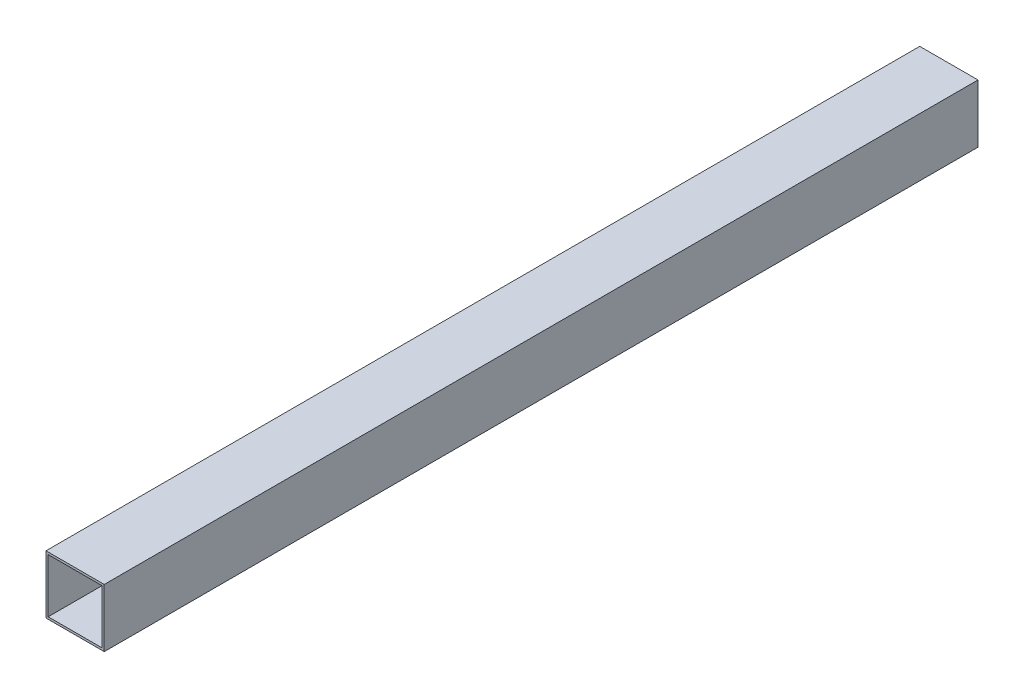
ISO-10303-21;
HEADER;
FILE_DESCRIPTION(('STEP AP214'),'2;1');
FILE_NAME('part.step','',(''),(''),'','','');
FILE_SCHEMA(('AUTOMOTIVE_DESIGN { 1 0 10303 214 1 1 1 1 }'));
ENDSEC;
DATA;
#1=APPLICATION_CONTEXT('core data for automotive mechanical design processes');
#2=APPLICATION_PROTOCOL_DEFINITION('international standard','automotive_design',2000,#1);
#3=PRODUCT_CONTEXT('',#1,'mechanical');
#4=PRODUCT('Part','Part','',(#3));
#5=PRODUCT_RELATED_PRODUCT_CATEGORY('part','',(#4));
#6=PRODUCT_DEFINITION_FORMATION('','',#4);
#7=PRODUCT_DEFINITION_CONTEXT('part definition',#1,'design');
#8=PRODUCT_DEFINITION('design','',#6,#7);
#9=PRODUCT_DEFINITION_SHAPE('','',#8);
#10=(LENGTH_UNIT() NAMED_UNIT(*) SI_UNIT(.MILLI.,.METRE.));
#11=(NAMED_UNIT(*) PLANE_ANGLE_UNIT() SI_UNIT($,.RADIAN.));
#12=(NAMED_UNIT(*) SI_UNIT($,.STERADIAN.) SOLID_ANGLE_UNIT());
#13=UNCERTAINTY_MEASURE_WITH_UNIT(LENGTH_MEASURE(1.E-05),#10,'distance_accuracy_value','');
#14=(GEOMETRIC_REPRESENTATION_CONTEXT(3) GLOBAL_UNCERTAINTY_ASSIGNED_CONTEXT((#13)) GLOBAL_UNIT_ASSIGNED_CONTEXT((#10,
#11,#12)) REPRESENTATION_CONTEXT('',''));
#15=CARTESIAN_POINT('',(0.,0.,0.));
#16=DIRECTION('',(0.,0.,1.));
#17=DIRECTION('',(1.,0.,0.));
#18=AXIS2_PLACEMENT_3D('',#15,#16,#17);
#19=CARTESIAN_POINT('',(0.,80.,1200.));
#20=DIRECTION('',(0.,0.,-1.));
#21=DIRECTION('',(-1.,0.,0.));
#22=AXIS2_PLACEMENT_3D('',#19,#20,#21);
#23=PLANE('',#22);
#24=DIRECTION('',(0.,-1.,0.));
#25=VECTOR('',#24,1.);
#26=CARTESIAN_POINT('',(0.,0.,1200.));
#27=LINE('',#26,#25);
#28=CARTESIAN_POINT('',(0.,80.,1200.));
#29=VERTEX_POINT('',#28);
#30=CARTESIAN_POINT('',(0.,0.,1200.));
#31=VERTEX_POINT('',#30);
#32=EDGE_CURVE('E141',#29,#31,#27,.T.);
#33=ORIENTED_EDGE('',*,*,#32,.T.);
#34=DIRECTION('',(1.,0.,0.));
#35=VECTOR('',#34,1.);
#36=CARTESIAN_POINT('',(0.,0.,1200.));
#37=LINE('',#36,#35);
#38=CARTESIAN_POINT('',(80.,0.,1200.));
#39=VERTEX_POINT('',#38);
#40=EDGE_CURVE('E144',#31,#39,#37,.T.);
#41=ORIENTED_EDGE('',*,*,#40,.T.);
#42=DIRECTION('',(0.,1.,0.));
#43=VECTOR('',#42,1.);
#44=CARTESIAN_POINT('',(80.,0.,1200.));
#45=LINE('',#44,#43);
#46=CARTESIAN_POINT('',(80.,80.,1200.));
#47=VERTEX_POINT('',#46);
#48=EDGE_CURVE('E146',#39,#47,#45,.T.);
#49=ORIENTED_EDGE('',*,*,#48,.T.);
#50=DIRECTION('',(-1.,0.,0.));
#51=VECTOR('',#50,1.);
#52=CARTESIAN_POINT('',(0.,80.,1200.));
#53=LINE('',#52,#51);
#54=EDGE_CURVE('E148',#47,#29,#53,.T.);
#55=ORIENTED_EDGE('',*,*,#54,.T.);
#56=EDGE_LOOP('',(#33,#41,#49,#55));
#57=FACE_BOUND('',#56,.T.);
#58=DIRECTION('',(0.,-1.,0.));
#59=VECTOR('',#58,1.);
#60=CARTESIAN_POINT('',(2.99999999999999,77.,1200.));
#61=LINE('',#60,#59);
#62=CARTESIAN_POINT('',(2.99999999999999,77.,1200.));
#63=VERTEX_POINT('',#62);
#64=CARTESIAN_POINT('',(3.,3.,1200.));
#65=VERTEX_POINT('',#64);
#66=EDGE_CURVE('E112',#63,#65,#61,.T.);
#67=ORIENTED_EDGE('',*,*,#66,.F.);
#68=DIRECTION('',(-1.,0.,0.));
#69=VECTOR('',#68,1.);
#70=CARTESIAN_POINT('',(2.99999999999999,77.,1200.));
#71=LINE('',#70,#69);
#72=CARTESIAN_POINT('',(77.,77.,1200.));
#73=VERTEX_POINT('',#72);
#74=EDGE_CURVE('E127',#73,#63,#71,.T.);
#75=ORIENTED_EDGE('',*,*,#74,.F.);
#76=DIRECTION('',(0.,1.,0.));
#77=VECTOR('',#76,1.);
#78=CARTESIAN_POINT('',(77.,77.,1200.));
#79=LINE('',#78,#77);
#80=CARTESIAN_POINT('',(77.,3.,1200.));
#81=VERTEX_POINT('',#80);
#82=EDGE_CURVE('E125',#81,#73,#79,.T.);
#83=ORIENTED_EDGE('',*,*,#82,.F.);
#84=DIRECTION('',(1.,0.,0.));
#85=VECTOR('',#84,1.);
#86=CARTESIAN_POINT('',(3.,3.,1200.));
#87=LINE('',#86,#85);
#88=EDGE_CURVE('E123',#65,#81,#87,.T.);
#89=ORIENTED_EDGE('',*,*,#88,.F.);
#90=EDGE_LOOP('',(#67,#75,#83,#89));
#91=FACE_BOUND('',#90,.T.);
#92=ADVANCED_FACE('F32',(#57,#91),#23,.F.);
#93=CARTESIAN_POINT('',(0.,80.,0.));
#94=DIRECTION('',(0.,0.,-1.));
#95=DIRECTION('',(-1.,0.,0.));
#96=AXIS2_PLACEMENT_3D('',#93,#94,#95);
#97=PLANE('',#96);
#98=DIRECTION('',(0.,-1.,0.));
#99=VECTOR('',#98,1.);
#100=CARTESIAN_POINT('',(0.,0.,0.));
#101=LINE('',#100,#99);
#102=CARTESIAN_POINT('',(0.,80.,0.));
#103=VERTEX_POINT('',#102);
#104=CARTESIAN_POINT('',(0.,0.,0.));
#105=VERTEX_POINT('',#104);
#106=EDGE_CURVE('E113',#103,#105,#101,.T.);
#107=ORIENTED_EDGE('',*,*,#106,.F.);
#108=DIRECTION('',(-1.,0.,0.));
#109=VECTOR('',#108,1.);
#110=CARTESIAN_POINT('',(0.,80.,0.));
#111=LINE('',#110,#109);
#112=CARTESIAN_POINT('',(80.,80.,0.));
#113=VERTEX_POINT('',#112);
#114=EDGE_CURVE('E139',#113,#103,#111,.T.);
#115=ORIENTED_EDGE('',*,*,#114,.F.);
#116=DIRECTION('',(0.,1.,0.));
#117=VECTOR('',#116,1.);
#118=CARTESIAN_POINT('',(80.,0.,0.));
#119=LINE('',#118,#117);
#120=CARTESIAN_POINT('',(80.,0.,0.));
#121=VERTEX_POINT('',#120);
#122=EDGE_CURVE('E137',#121,#113,#119,.T.);
#123=ORIENTED_EDGE('',*,*,#122,.F.);
#124=DIRECTION('',(1.,0.,0.));
#125=VECTOR('',#124,1.);
#126=CARTESIAN_POINT('',(0.,0.,0.));
#127=LINE('',#126,#125);
#128=EDGE_CURVE('E135',#105,#121,#127,.T.);
#129=ORIENTED_EDGE('',*,*,#128,.F.);
#130=EDGE_LOOP('',(#107,#115,#123,#129));
#131=FACE_BOUND('',#130,.T.);
#132=DIRECTION('',(-1.,0.,0.));
#133=VECTOR('',#132,1.);
#134=CARTESIAN_POINT('',(2.99999999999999,77.,0.));
#135=LINE('',#134,#133);
#136=CARTESIAN_POINT('',(77.,77.,0.));
#137=VERTEX_POINT('',#136);
#138=CARTESIAN_POINT('',(2.99999999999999,77.,0.));
#139=VERTEX_POINT('',#138);
#140=EDGE_CURVE('E117',#137,#139,#135,.T.);
#141=ORIENTED_EDGE('',*,*,#140,.T.);
#142=DIRECTION('',(0.,-1.,0.));
#143=VECTOR('',#142,1.);
#144=CARTESIAN_POINT('',(2.99999999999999,77.,0.));
#145=LINE('',#144,#143);
#146=CARTESIAN_POINT('',(3.,3.,0.));
#147=VERTEX_POINT('',#146);
#148=EDGE_CURVE('E55',#139,#147,#145,.T.);
#149=ORIENTED_EDGE('',*,*,#148,.T.);
#150=DIRECTION('',(1.,0.,0.));
#151=VECTOR('',#150,1.);
#152=CARTESIAN_POINT('',(3.,3.,0.));
#153=LINE('',#152,#151);
#154=CARTESIAN_POINT('',(77.,3.,0.));
#155=VERTEX_POINT('',#154);
#156=EDGE_CURVE('E99',#147,#155,#153,.T.);
#157=ORIENTED_EDGE('',*,*,#156,.T.);
#158=DIRECTION('',(0.,1.,0.));
#159=VECTOR('',#158,1.);
#160=CARTESIAN_POINT('',(77.,77.,0.));
#161=LINE('',#160,#159);
#162=EDGE_CURVE('E108',#155,#137,#161,.T.);
#163=ORIENTED_EDGE('',*,*,#162,.T.);
#164=EDGE_LOOP('',(#141,#149,#157,#163));
#165=FACE_BOUND('',#164,.T.);
#166=ADVANCED_FACE('F116',(#131,#165),#97,.T.);
#167=CARTESIAN_POINT('',(0.,0.,1200.));
#168=DIRECTION('',(1.,0.,0.));
#169=DIRECTION('',(0.,1.,0.));
#170=AXIS2_PLACEMENT_3D('',#167,#168,#169);
#171=PLANE('',#170);
#172=ORIENTED_EDGE('',*,*,#106,.T.);
#173=DIRECTION('',(0.,0.,-1.));
#174=VECTOR('',#173,1.);
#175=CARTESIAN_POINT('',(0.,0.,1200.));
#176=LINE('',#175,#174);
#177=EDGE_CURVE('E11',#31,#105,#176,.T.);
#178=ORIENTED_EDGE('',*,*,#177,.F.);
#179=ORIENTED_EDGE('',*,*,#32,.F.);
#180=DIRECTION('',(0.,0.,-1.));
#181=VECTOR('',#180,1.);
#182=CARTESIAN_POINT('',(0.,80.,1200.));
#183=LINE('',#182,#181);
#184=EDGE_CURVE('E150',#29,#103,#183,.T.);
#185=ORIENTED_EDGE('',*,*,#184,.T.);
#186=EDGE_LOOP('',(#172,#178,#179,#185));
#187=FACE_BOUND('',#186,.T.);
#188=ADVANCED_FACE('F34',(#187),#171,.F.);
#189=CARTESIAN_POINT('',(0.,0.,1200.));
#190=DIRECTION('',(0.,1.,0.));
#191=DIRECTION('',(0.,0.,1.));
#192=AXIS2_PLACEMENT_3D('',#189,#190,#191);
#193=PLANE('',#192);
#194=ORIENTED_EDGE('',*,*,#128,.T.);
#195=DIRECTION('',(0.,0.,-1.));
#196=VECTOR('',#195,1.);
#197=CARTESIAN_POINT('',(80.,0.,1200.));
#198=LINE('',#197,#196);
#199=EDGE_CURVE('E40',#39,#121,#198,.T.);
#200=ORIENTED_EDGE('',*,*,#199,.F.);
#201=ORIENTED_EDGE('',*,*,#40,.F.);
#202=ORIENTED_EDGE('',*,*,#177,.T.);
#203=EDGE_LOOP('',(#194,#200,#201,#202));
#204=FACE_BOUND('',#203,.T.);
#205=ADVANCED_FACE('F175',(#204),#193,.F.);
#206=CARTESIAN_POINT('',(80.,0.,1200.));
#207=DIRECTION('',(-1.,0.,0.));
#208=DIRECTION('',(0.,0.,1.));
#209=AXIS2_PLACEMENT_3D('',#206,#207,#208);
#210=PLANE('',#209);
#211=ORIENTED_EDGE('',*,*,#122,.T.);
#212=DIRECTION('',(0.,0.,-1.));
#213=VECTOR('',#212,1.);
#214=CARTESIAN_POINT('',(80.,80.,1200.));
#215=LINE('',#214,#213);
#216=EDGE_CURVE('E153',#47,#113,#215,.T.);
#217=ORIENTED_EDGE('',*,*,#216,.F.);
#218=ORIENTED_EDGE('',*,*,#48,.F.);
#219=ORIENTED_EDGE('',*,*,#199,.T.);
#220=EDGE_LOOP('',(#211,#217,#218,#219));
#221=FACE_BOUND('',#220,.T.);
#222=ADVANCED_FACE('F160',(#221),#210,.F.);
#223=CARTESIAN_POINT('',(0.,80.,1200.));
#224=DIRECTION('',(0.,-1.,0.));
#225=DIRECTION('',(0.,0.,-1.));
#226=AXIS2_PLACEMENT_3D('',#223,#224,#225);
#227=PLANE('',#226);
#228=ORIENTED_EDGE('',*,*,#114,.T.);
#229=ORIENTED_EDGE('',*,*,#184,.F.);
#230=ORIENTED_EDGE('',*,*,#54,.F.);
#231=ORIENTED_EDGE('',*,*,#216,.T.);
#232=EDGE_LOOP('',(#228,#229,#230,#231));
#233=FACE_BOUND('',#232,.T.);
#234=ADVANCED_FACE('F168',(#233),#227,.F.);
#235=CARTESIAN_POINT('',(2.99999999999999,77.,1200.));
#236=DIRECTION('',(1.,0.,0.));
#237=DIRECTION('',(0.,1.,0.));
#238=AXIS2_PLACEMENT_3D('',#235,#236,#237);
#239=PLANE('',#238);
#240=ORIENTED_EDGE('',*,*,#148,.F.);
#241=DIRECTION('',(0.,0.,-1.));
#242=VECTOR('',#241,1.);
#243=CARTESIAN_POINT('',(2.99999999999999,77.,1200.));
#244=LINE('',#243,#242);
#245=EDGE_CURVE('E129',#63,#139,#244,.T.);
#246=ORIENTED_EDGE('',*,*,#245,.F.);
#247=ORIENTED_EDGE('',*,*,#66,.T.);
#248=DIRECTION('',(0.,0.,-1.));
#249=VECTOR('',#248,1.);
#250=CARTESIAN_POINT('',(3.,3.,1200.));
#251=LINE('',#250,#249);
#252=EDGE_CURVE('E101',#65,#147,#251,.T.);
#253=ORIENTED_EDGE('',*,*,#252,.T.);
#254=EDGE_LOOP('',(#240,#246,#247,#253));
#255=FACE_BOUND('',#254,.T.);
#256=ADVANCED_FACE('F110',(#255),#239,.T.);
#257=CARTESIAN_POINT('',(3.,3.,1200.));
#258=DIRECTION('',(0.,1.,0.));
#259=DIRECTION('',(0.,0.,1.));
#260=AXIS2_PLACEMENT_3D('',#257,#258,#259);
#261=PLANE('',#260);
#262=ORIENTED_EDGE('',*,*,#156,.F.);
#263=ORIENTED_EDGE('',*,*,#252,.F.);
#264=ORIENTED_EDGE('',*,*,#88,.T.);
#265=DIRECTION('',(0.,0.,-1.));
#266=VECTOR('',#265,1.);
#267=CARTESIAN_POINT('',(77.,3.,1200.));
#268=LINE('',#267,#266);
#269=EDGE_CURVE('E104',#81,#155,#268,.T.);
#270=ORIENTED_EDGE('',*,*,#269,.T.);
#271=EDGE_LOOP('',(#262,#263,#264,#270));
#272=FACE_BOUND('',#271,.T.);
#273=ADVANCED_FACE('F100',(#272),#261,.T.);
#274=CARTESIAN_POINT('',(77.,77.,1200.));
#275=DIRECTION('',(-1.,0.,0.));
#276=DIRECTION('',(0.,0.,1.));
#277=AXIS2_PLACEMENT_3D('',#274,#275,#276);
#278=PLANE('',#277);
#279=ORIENTED_EDGE('',*,*,#162,.F.);
#280=ORIENTED_EDGE('',*,*,#269,.F.);
#281=ORIENTED_EDGE('',*,*,#82,.T.);
#282=DIRECTION('',(0.,0.,-1.));
#283=VECTOR('',#282,1.);
#284=CARTESIAN_POINT('',(77.,77.,1200.));
#285=LINE('',#284,#283);
#286=EDGE_CURVE('E47',#73,#137,#285,.T.);
#287=ORIENTED_EDGE('',*,*,#286,.T.);
#288=EDGE_LOOP('',(#279,#280,#281,#287));
#289=FACE_BOUND('',#288,.T.);
#290=ADVANCED_FACE('F197',(#289),#278,.T.);
#291=CARTESIAN_POINT('',(2.99999999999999,77.,1200.));
#292=DIRECTION('',(0.,-1.,0.));
#293=DIRECTION('',(0.,0.,-1.));
#294=AXIS2_PLACEMENT_3D('',#291,#292,#293);
#295=PLANE('',#294);
#296=ORIENTED_EDGE('',*,*,#140,.F.);
#297=ORIENTED_EDGE('',*,*,#286,.F.);
#298=ORIENTED_EDGE('',*,*,#74,.T.);
#299=ORIENTED_EDGE('',*,*,#245,.T.);
#300=EDGE_LOOP('',(#296,#297,#298,#299));
#301=FACE_BOUND('',#300,.T.);
#302=ADVANCED_FACE('F202',(#301),#295,.T.);
#303=CLOSED_SHELL('',(#92,#166,#188,#205,#222,#234,#256,#273,#290,#302));
#304=MANIFOLD_SOLID_BREP('B2',#303);
#305=ADVANCED_BREP_SHAPE_REPRESENTATION('',(#18,#304),#14);
#306=SHAPE_DEFINITION_REPRESENTATION(#9,#305);
ENDSEC;
END-ISO-10303-21;
